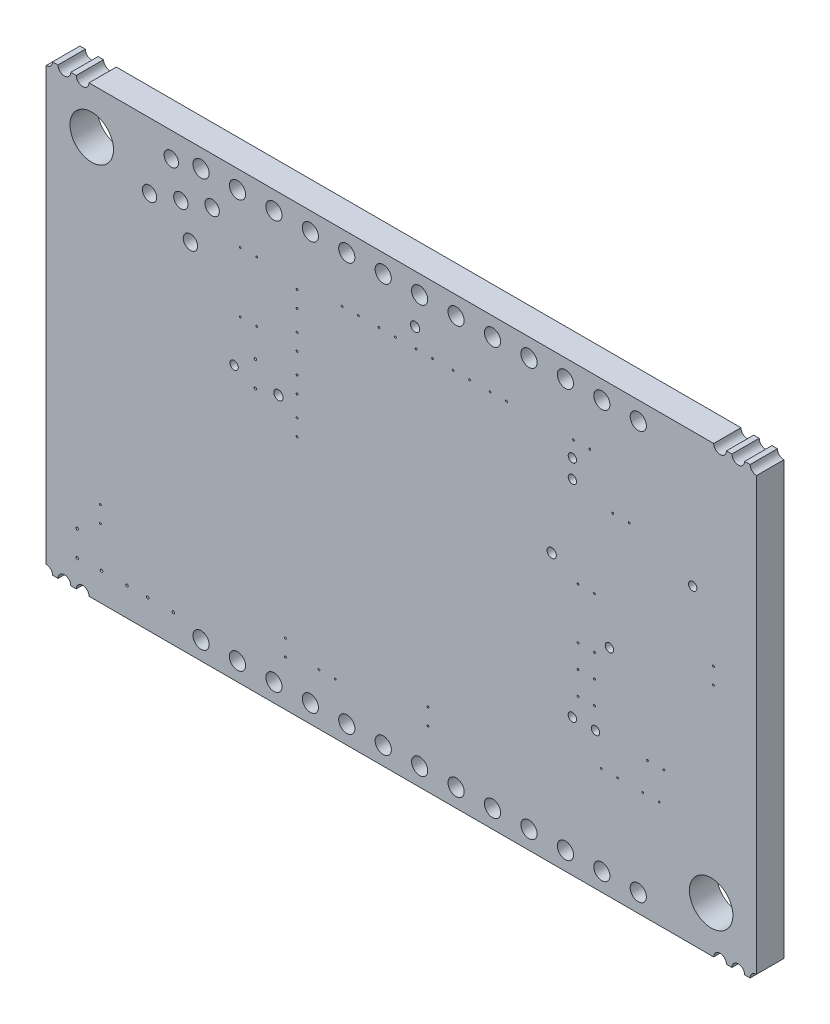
from build123d import *

# Parameters (mm, degrees)
SKETCH1_W           = 38.989
SKETCH1_H           = 24.4094
BOARD_OUTLINE_DEPTH = 1.5
SKETCH2_R           = 0.254
NPTH_DEPTH          = 43.582777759
SKETCH3_R           = 0.4445
SKETCH3_R_2         = 1.1938
SKETCH3_R_3         = 0.3937
SKETCH3_R_4         = 0.05
SKETCH3_R_5         = 0.07
SKETCH3_R_6         = 0.2286
PTH_DEPTH           = 43.582777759
CUT_EXTRUDE1_REACH  = 44.583
SKETCH5_R           = 0.35
LPATTERN1_COUNT     = 3
LPATTERN1_PITCH     = 1
CUT_EXTRUDE2_REACH  = 44.583
SKETCH6_R           = 0.35
LPATTERN2_COUNT     = 3
LPATTERN2_PITCH     = 1


with BuildPart() as part:
    # Sketch1 → Board_Outline (new body)
    with BuildSketch(Plane.XY):
        with Locations((16.994378, -9.69518)):
            Rectangle(SKETCH1_W, SKETCH1_H)
    extrude(amount=BOARD_OUTLINE_DEPTH)

    # Sketch2 → NPTH (cut, through all)
    with BuildSketch(Plane.XY):
        with Locations((25.24696, -7.135876)):
            Circle(SKETCH2_R)
        with Locations((10.24696, -7.135876)):
            Circle(SKETCH2_R)
        with Locations((17.74696, -0.135876)):
            Circle(SKETCH2_R)
    extrude(amount=NPTH_DEPTH, mode=Mode.SUBTRACT)

    # Sketch3 → PTH (cut, through all)
    with BuildSketch(Plane.XY):
        with Locations((11.99996, -20.899882)):
            Circle(SKETCH3_R)
        with Locations((13.99996, -20.899882)):
            Circle(SKETCH3_R)
        with Locations((15.99996, -20.899882)):
            Circle(SKETCH3_R)
        with Locations((17.99996, -20.899882)):
            Circle(SKETCH3_R)
        with Locations((19.99996, -20.899882)):
            Circle(SKETCH3_R)
        with Locations((21.99996, -20.899882)):
            Circle(SKETCH3_R)
        with Locations((23.99996, -20.899882)):
            Circle(SKETCH3_R)
        with Locations((25.99996, -20.899882)):
            Circle(SKETCH3_R)
        with Locations((27.99996, -20.899882)):
            Circle(SKETCH3_R)
        with Locations((29.99996, -20.899882)):
            Circle(SKETCH3_R)
        with Locations((9.99996, -20.899882)):
            Circle(SKETCH3_R)
        with Locations((11.99996, 1.500124)):
            Circle(SKETCH3_R)
        with Locations((13.99996, 1.500124)):
            Circle(SKETCH3_R)
        with Locations((15.99996, 1.500124)):
            Circle(SKETCH3_R)
        with Locations((17.99996, 1.500124)):
            Circle(SKETCH3_R)
        with Locations((19.99996, 1.500124)):
            Circle(SKETCH3_R)
        with Locations((21.99996, 1.500124)):
            Circle(SKETCH3_R)
        with Locations((23.99996, 1.500124)):
            Circle(SKETCH3_R)
        with Locations((25.99996, 1.500124)):
            Circle(SKETCH3_R)
        with Locations((27.99996, 1.500124)):
            Circle(SKETCH3_R)
        with Locations((29.99996, 1.500124)):
            Circle(SKETCH3_R)
        with Locations((9.99996, 1.500124)):
            Circle(SKETCH3_R)
        with Locations((33.999932, -19.399758)):
            Circle(SKETCH3_R_2)
        Circle(SKETCH3_R_2)
        with Locations((4.89128, -0.563876)):
            Circle(SKETCH3_R_3)
        with Locations((6.608852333, -0.038761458)):
            Circle(SKETCH3_R_3)
        with Locations((4.366165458, 1.153696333)):
            Circle(SKETCH3_R_3)
        with Locations((5.416394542, -2.281448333)):
            Circle(SKETCH3_R_3)
        with Locations((3.173707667, -1.088990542)):
            Circle(SKETCH3_R_3)
        with Locations((27.59496, -10.691876)):
            Circle(SKETCH3_R_4)
        with Locations((26.69496, -10.691876)):
            Circle(SKETCH3_R_4)
        with Locations((11.26996, -1.605876)):
            Circle(SKETCH3_R_4)
        with Locations((11.26996, -2.505876)):
            Circle(SKETCH3_R_4)
        with Locations((11.26996, -3.637876)):
            Circle(SKETCH3_R_4)
        with Locations((11.26996, -4.537876)):
            Circle(SKETCH3_R_4)
        with Locations((28.86496, -16.025876)):
            Circle(SKETCH3_R_4)
        with Locations((27.96496, -16.025876)):
            Circle(SKETCH3_R_4)
        with Locations((14.64096, -1.166876)):
            Circle(SKETCH3_R_4)
        with Locations((13.74096, -1.166876)):
            Circle(SKETCH3_R_4)
        with Locations((15.77296, -1.166876)):
            Circle(SKETCH3_R_4)
        with Locations((16.67296, -1.166876)):
            Circle(SKETCH3_R_4)
        with Locations((17.80496, -1.166876)):
            Circle(SKETCH3_R_4)
        with Locations((18.70496, -1.166876)):
            Circle(SKETCH3_R_4)
        with Locations((11.26996, -5.669876)):
            Circle(SKETCH3_R_4)
        with Locations((11.26996, -6.569876)):
            Circle(SKETCH3_R_4)
        with Locations((21.86896, -1.166876)):
            Circle(SKETCH3_R_4)
        with Locations((22.76896, -1.166876)):
            Circle(SKETCH3_R_4)
        with Locations((19.83696, -1.166876)):
            Circle(SKETCH3_R_4)
        with Locations((20.73696, -1.166876)):
            Circle(SKETCH3_R_4)
        with Locations((11.26996, -7.701876)):
            Circle(SKETCH3_R_4)
        with Locations((11.26996, -8.601876)):
            Circle(SKETCH3_R_4)
        with Locations((26.44096, -1.166876)):
            Circle(SKETCH3_R_4)
        with Locations((27.34096, -1.166876)):
            Circle(SKETCH3_R_4)
        with Locations((0.47496, -18.126876)):
            Circle(SKETCH3_R_4)
        with Locations((0.47496, -17.226876)):
            Circle(SKETCH3_R_4)
        with Locations((8.15296, -4.468876)):
            Circle(SKETCH3_R_4)
        with Locations((9.05296, -4.468876)):
            Circle(SKETCH3_R_4)
        with Locations((34.12996, -8.982876)):
            Circle(SKETCH3_R_4)
        with Locations((34.12996, -8.082876)):
            Circle(SKETCH3_R_4)
        with Locations((27.59496, -7.897876)):
            Circle(SKETCH3_R_4)
        with Locations((26.69496, -7.897876)):
            Circle(SKETCH3_R_4)
        with Locations((30.50496, -14.374876)):
            Circle(SKETCH3_R_4)
        with Locations((31.40496, -14.374876)):
            Circle(SKETCH3_R_4)
        with Locations((28.59996, -3.579876)):
            Circle(SKETCH3_R_4)
        with Locations((29.49996, -3.579876)):
            Circle(SKETCH3_R_4)
        with Locations((31.15096, -16.025876)):
            Circle(SKETCH3_R_4)
        with Locations((30.25096, -16.025876)):
            Circle(SKETCH3_R_4)
        with Locations((26.69496, -13.231876)):
            Circle(SKETCH3_R_4)
        with Locations((27.59496, -13.231876)):
            Circle(SKETCH3_R_4)
        with Locations((26.69496, -11.961876)):
            Circle(SKETCH3_R_4)
        with Locations((27.59496, -11.961876)):
            Circle(SKETCH3_R_4)
        with Locations((10.63496, -18.496876)):
            Circle(SKETCH3_R_4)
        with Locations((10.63496, -19.396876)):
            Circle(SKETCH3_R_4)
        with Locations((8.15296, -1.166876)):
            Circle(SKETCH3_R_4)
        with Locations((9.05296, -1.166876)):
            Circle(SKETCH3_R_4)
        with Locations((12.47096, -19.073876)):
            Circle(SKETCH3_R_4)
        with Locations((13.37096, -19.073876)):
            Circle(SKETCH3_R_4)
        with Locations((18.45816, -17.861876)):
            Circle(SKETCH3_R_4)
        with Locations((18.45816, -18.761876)):
            Circle(SKETCH3_R_4)
        with Locations((8.98396, -7.454876)):
            Circle(SKETCH3_R_5)
        with Locations((8.98396, -6.054876)):
            Circle(SKETCH3_R_5)
        with Locations((-0.79504, -20.408876)):
            Circle(SKETCH3_R_5)
        with Locations((-0.79504, -19.008876)):
            Circle(SKETCH3_R_5)
        with Locations((1.93696, -20.343876)):
            Circle(SKETCH3_R_5)
        with Locations((0.53696, -20.343876)):
            Circle(SKETCH3_R_5)
        with Locations((4.47696, -20.343876)):
            Circle(SKETCH3_R_5)
        with Locations((3.07696, -20.343876)):
            Circle(SKETCH3_R_5)
        with Locations((7.81556, -6.932676)):
            Circle(SKETCH3_R_6)
        with Locations((27.65296, -14.374876)):
            Circle(SKETCH3_R_6)
        with Locations((26.38296, -3.071876)):
            Circle(SKETCH3_R_6)
        with Locations((26.38296, -14.374876)):
            Circle(SKETCH3_R_6)
        with Locations((32.98696, -4.849876)):
            Circle(SKETCH3_R_6)
        with Locations((28.41496, -10.056876)):
            Circle(SKETCH3_R_6)
        with Locations((26.38296, -2.055876)):
            Circle(SKETCH3_R_6)
        with Locations((5.99996, -20.899876)):
            Circle(SKETCH3_R)
        with Locations((7.99996, -20.899876)):
            Circle(SKETCH3_R)
        with Locations((5.99996, 1.500124)):
            Circle(SKETCH3_R)
        with Locations((7.99996, 1.500124)):
            Circle(SKETCH3_R)
    extrude(amount=PTH_DEPTH, mode=Mode.SUBTRACT)

    # Sketch5 → Cut-Extrude1 (cut, up to next)
    with BuildSketch(Plane.XY.offset(1.5), mode=Mode.PRIVATE) as cut_extrude1_sk1:
        with Locations((36.488878, 2.50952)):
            Circle(SKETCH5_R)
    cut_extrude1_tool1 = extrude(cut_extrude1_sk1.sketch, amount=-CUT_EXTRUDE1_REACH, mode=Mode.PRIVATE) & part.part
    # Sketch5 → Cut-Extrude1 (cut, up to next)
    with BuildSketch(Plane.XY.offset(1.5), mode=Mode.PRIVATE) as cut_extrude1_sk2:
        with Locations((36.488878, -21.89988)):
            Circle(SKETCH5_R)
    cut_extrude1_tool2 = extrude(cut_extrude1_sk2.sketch, amount=-CUT_EXTRUDE1_REACH, mode=Mode.PRIVATE) & part.part
    cut_extrude1_1 = cut_extrude1_tool1.solids().sort_by_distance((36.488878, 2.50952, 1.5))[0]
    add(cut_extrude1_1, mode=Mode.SUBTRACT)
    cut_extrude1_2 = cut_extrude1_tool2.solids().sort_by_distance((36.488878, -21.89988, 1.5))[0]
    add(cut_extrude1_2, mode=Mode.SUBTRACT)
    cut_extrude1 = cut_extrude1_1 + cut_extrude1_2  # Cut-Extrude1 as one shape, for the pattern or mirror that repeats it

    # LPattern1: Cut-Extrude1; each copy of Cut-Extrude1 runs up to whatever stops it at its own place
    lpattern1_before = part.part  # the part as the pattern finds it: every copy runs up to it
    lpattern1_cut_extrude1_long1 = extrude(cut_extrude1_sk1.sketch, amount=-CUT_EXTRUDE1_REACH, mode=Mode.PRIVATE)
    lpattern1_cut_extrude1_long2 = extrude(cut_extrude1_sk2.sketch, amount=-CUT_EXTRUDE1_REACH, mode=Mode.PRIVATE)
    lpattern1_cut_extrude1_tool1_1 = lpattern1_cut_extrude1_long1.moved(Location(Vector(-1, 0, 0) * (1 * LPATTERN1_PITCH))) & lpattern1_before
    add(lpattern1_cut_extrude1_tool1_1.solids().sort_by_distance((35.488878, 2.50952, 1.5))[0], mode=Mode.SUBTRACT)
    lpattern1_cut_extrude1_tool2_1 = lpattern1_cut_extrude1_long2.moved(Location(Vector(-1, 0, 0) * (1 * LPATTERN1_PITCH))) & lpattern1_before
    add(lpattern1_cut_extrude1_tool2_1.solids().sort_by_distance((35.488878, -21.89988, 1.5))[0], mode=Mode.SUBTRACT)
    lpattern1_cut_extrude1_tool1_2 = lpattern1_cut_extrude1_long1.moved(Location(Vector(-1, 0, 0) * (2 * LPATTERN1_PITCH))) & lpattern1_before
    add(lpattern1_cut_extrude1_tool1_2.solids().sort_by_distance((34.488878, 2.50952, 1.5))[0], mode=Mode.SUBTRACT)
    lpattern1_cut_extrude1_tool2_2 = lpattern1_cut_extrude1_long2.moved(Location(Vector(-1, 0, 0) * (2 * LPATTERN1_PITCH))) & lpattern1_before
    add(lpattern1_cut_extrude1_tool2_2.solids().sort_by_distance((34.488878, -21.89988, 1.5))[0], mode=Mode.SUBTRACT)

    # Sketch6 → Cut-Extrude2 (cut, up to next)
    with BuildSketch(Plane.XY.offset(1.5), mode=Mode.PRIVATE) as cut_extrude2_sk1:
        with Locations((-2.500122, 2.50952)):
            Circle(SKETCH6_R)
    cut_extrude2_tool1 = extrude(cut_extrude2_sk1.sketch, amount=-CUT_EXTRUDE2_REACH, mode=Mode.PRIVATE) & part.part
    # Sketch6 → Cut-Extrude2 (cut, up to next)
    with BuildSketch(Plane.XY.offset(1.5), mode=Mode.PRIVATE) as cut_extrude2_sk2:
        with Locations((-2.500122, -21.89988)):
            Circle(SKETCH6_R)
    cut_extrude2_tool2 = extrude(cut_extrude2_sk2.sketch, amount=-CUT_EXTRUDE2_REACH, mode=Mode.PRIVATE) & part.part
    cut_extrude2_1 = cut_extrude2_tool1.solids().sort_by_distance((-2.500122, 2.50952, 1.5))[0]
    add(cut_extrude2_1, mode=Mode.SUBTRACT)
    cut_extrude2_2 = cut_extrude2_tool2.solids().sort_by_distance((-2.500122, -21.89988, 1.5))[0]
    add(cut_extrude2_2, mode=Mode.SUBTRACT)
    cut_extrude2 = cut_extrude2_1 + cut_extrude2_2  # Cut-Extrude2 as one shape, for the pattern or mirror that repeats it

    # LPattern2: Cut-Extrude2; each copy of Cut-Extrude2 runs up to whatever stops it at its own place
    lpattern2_before = part.part  # the part as the pattern finds it: every copy runs up to it
    lpattern2_cut_extrude2_long1 = extrude(cut_extrude2_sk1.sketch, amount=-CUT_EXTRUDE2_REACH, mode=Mode.PRIVATE)
    lpattern2_cut_extrude2_long2 = extrude(cut_extrude2_sk2.sketch, amount=-CUT_EXTRUDE2_REACH, mode=Mode.PRIVATE)
    lpattern2_cut_extrude2_tool1_1 = lpattern2_cut_extrude2_long1.moved(Location(Vector(1, 0, 0) * (1 * LPATTERN2_PITCH))) & lpattern2_before
    add(lpattern2_cut_extrude2_tool1_1.solids().sort_by_distance((-1.500122, 2.50952, 1.5))[0], mode=Mode.SUBTRACT)
    lpattern2_cut_extrude2_tool2_1 = lpattern2_cut_extrude2_long2.moved(Location(Vector(1, 0, 0) * (1 * LPATTERN2_PITCH))) & lpattern2_before
    add(lpattern2_cut_extrude2_tool2_1.solids().sort_by_distance((-1.500122, -21.89988, 1.5))[0], mode=Mode.SUBTRACT)
    lpattern2_cut_extrude2_tool1_2 = lpattern2_cut_extrude2_long1.moved(Location(Vector(1, 0, 0) * (2 * LPATTERN2_PITCH))) & lpattern2_before
    add(lpattern2_cut_extrude2_tool1_2.solids().sort_by_distance((-0.500122, 2.50952, 1.5))[0], mode=Mode.SUBTRACT)
    lpattern2_cut_extrude2_tool2_2 = lpattern2_cut_extrude2_long2.moved(Location(Vector(1, 0, 0) * (2 * LPATTERN2_PITCH))) & lpattern2_before
    add(lpattern2_cut_extrude2_tool2_2.solids().sort_by_distance((-0.500122, -21.89988, 1.5))[0], mode=Mode.SUBTRACT)


solid = part.part
